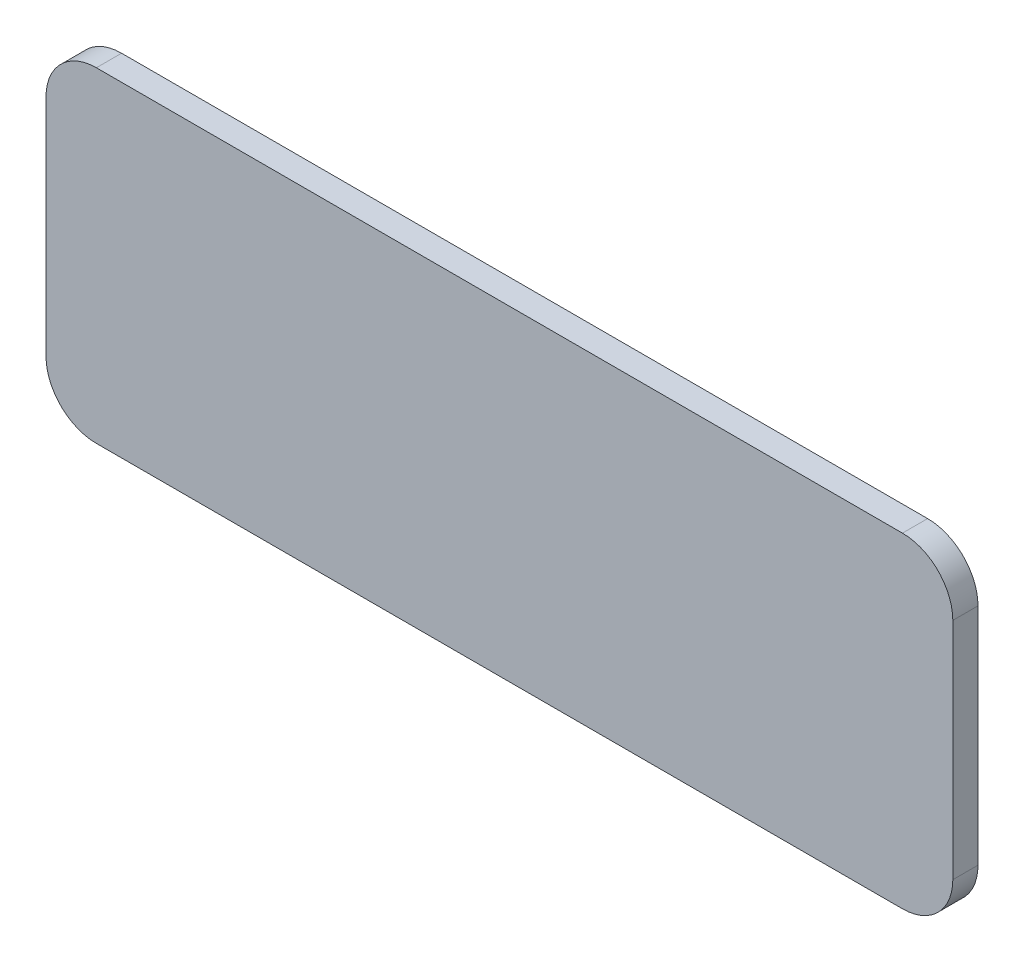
from build123d import *

# Parameters (mm, degrees)
LINEAR_AUSTRAGEN1_DEPTH = 0.5


with BuildPart() as part:
    # Skizze1 → Linear austragen1 (new body)
    with BuildSketch(Plane.XY):
        with BuildLine():
            Line((15.5, -0.091955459), (31.5, -0.091955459))
            ThreePointArc((31.5, -0.091955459), (32.207106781, -0.384848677), (32.5, -1.091955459))
            Line((32.5, -1.091955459), (32.5, -5.55))
            ThreePointArc((32.5, -5.55), (32.207106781, -6.257106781), (31.5, -6.55))
            Line((31.5, -6.55), (15.5, -6.55))
            ThreePointArc((15.5, -6.55), (14.792893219, -6.257106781), (14.5, -5.55))
            Line((14.5, -5.55), (14.5, -1.091955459))
            ThreePointArc((14.5, -1.091955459), (14.792893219, -0.384848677), (15.5, -0.091955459))
        make_face()
    extrude(amount=-LINEAR_AUSTRAGEN1_DEPTH)


solid = part.part
